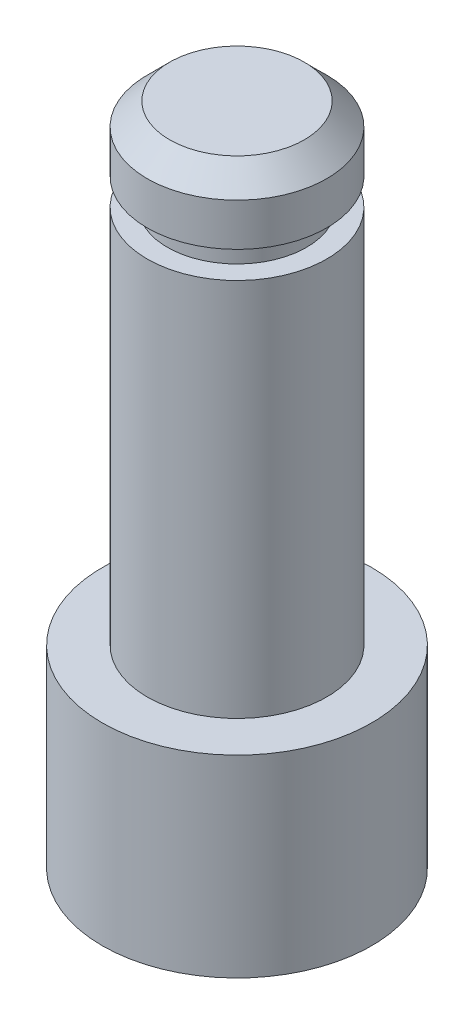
ISO-10303-21;
HEADER;
FILE_DESCRIPTION(('STEP AP214'),'2;1');
FILE_NAME('part.step','',(''),(''),'','','');
FILE_SCHEMA(('AUTOMOTIVE_DESIGN { 1 0 10303 214 1 1 1 1 }'));
ENDSEC;
DATA;
#1=APPLICATION_CONTEXT('core data for automotive mechanical design processes');
#2=APPLICATION_PROTOCOL_DEFINITION('international standard','automotive_design',2000,#1);
#3=PRODUCT_CONTEXT('',#1,'mechanical');
#4=PRODUCT('Part','Part','',(#3));
#5=PRODUCT_RELATED_PRODUCT_CATEGORY('part','',(#4));
#6=PRODUCT_DEFINITION_FORMATION('','',#4);
#7=PRODUCT_DEFINITION_CONTEXT('part definition',#1,'design');
#8=PRODUCT_DEFINITION('design','',#6,#7);
#9=PRODUCT_DEFINITION_SHAPE('','',#8);
#10=(LENGTH_UNIT() NAMED_UNIT(*) SI_UNIT(.MILLI.,.METRE.));
#11=(NAMED_UNIT(*) PLANE_ANGLE_UNIT() SI_UNIT($,.RADIAN.));
#12=(NAMED_UNIT(*) SI_UNIT($,.STERADIAN.) SOLID_ANGLE_UNIT());
#13=UNCERTAINTY_MEASURE_WITH_UNIT(LENGTH_MEASURE(1.E-05),#10,'distance_accuracy_value','');
#14=(GEOMETRIC_REPRESENTATION_CONTEXT(3) GLOBAL_UNCERTAINTY_ASSIGNED_CONTEXT((#13)) GLOBAL_UNIT_ASSIGNED_CONTEXT((#10,
#11,#12)) REPRESENTATION_CONTEXT('',''));
#15=CARTESIAN_POINT('',(0.,0.,0.));
#16=DIRECTION('',(0.,0.,1.));
#17=DIRECTION('',(1.,0.,0.));
#18=AXIS2_PLACEMENT_3D('',#15,#16,#17);
#19=CARTESIAN_POINT('',(0.,0.,0.));
#20=DIRECTION('',(0.,1.,0.));
#21=DIRECTION('',(0.,0.,1.));
#22=AXIS2_PLACEMENT_3D('',#19,#20,#21);
#23=CYLINDRICAL_SURFACE('',#22,3.);
#24=CARTESIAN_POINT('',(0.,20.,0.));
#25=DIRECTION('',(0.,1.,0.));
#26=DIRECTION('',(0.,0.,1.));
#27=AXIS2_PLACEMENT_3D('',#24,#25,#26);
#28=CIRCLE('',#27,3.);
#29=CARTESIAN_POINT('',(0.,20.,3.));
#30=VERTEX_POINT('',#29);
#31=EDGE_CURVE('E55',#30,#30,#28,.T.);
#32=ORIENTED_EDGE('',*,*,#31,.F.);
#33=EDGE_LOOP('',(#32));
#34=FACE_BOUND('',#33,.T.);
#35=CARTESIAN_POINT('',(0.,15.7,0.));
#36=DIRECTION('',(0.,-1.,0.));
#37=DIRECTION('',(0.,0.,-1.));
#38=AXIS2_PLACEMENT_3D('',#35,#36,#37);
#39=CIRCLE('',#38,3.);
#40=CARTESIAN_POINT('',(0.,15.7,-3.));
#41=VERTEX_POINT('',#40);
#42=EDGE_CURVE('E37',#41,#41,#39,.F.);
#43=ORIENTED_EDGE('',*,*,#42,.T.);
#44=EDGE_LOOP('',(#43));
#45=FACE_BOUND('',#44,.T.);
#46=ADVANCED_FACE('F33',(#34,#45),#23,.T.);
#47=CARTESIAN_POINT('',(0.,0.,0.));
#48=DIRECTION('',(0.,1.,0.));
#49=DIRECTION('',(0.,0.,1.));
#50=AXIS2_PLACEMENT_3D('',#47,#48,#49);
#51=CYLINDRICAL_SURFACE('',#50,2.);
#52=CARTESIAN_POINT('',(0.,20.,0.));
#53=DIRECTION('',(0.,1.,0.));
#54=DIRECTION('',(0.,0.,1.));
#55=AXIS2_PLACEMENT_3D('',#52,#53,#54);
#56=CIRCLE('',#55,2.);
#57=CARTESIAN_POINT('',(0.,20.,2.));
#58=VERTEX_POINT('',#57);
#59=EDGE_CURVE('E46',#58,#58,#56,.T.);
#60=ORIENTED_EDGE('',*,*,#59,.T.);
#61=EDGE_LOOP('',(#60));
#62=FACE_BOUND('',#61,.T.);
#63=CARTESIAN_POINT('',(0.,28.45,0.));
#64=DIRECTION('',(0.,1.,0.));
#65=DIRECTION('',(0.,0.,1.));
#66=AXIS2_PLACEMENT_3D('',#63,#64,#65);
#67=CIRCLE('',#66,2.);
#68=CARTESIAN_POINT('',(0.,28.45,2.));
#69=VERTEX_POINT('',#68);
#70=EDGE_CURVE('E52',#69,#69,#67,.F.);
#71=ORIENTED_EDGE('',*,*,#70,.T.);
#72=EDGE_LOOP('',(#71));
#73=FACE_BOUND('',#72,.T.);
#74=ADVANCED_FACE('F82',(#62,#73),#51,.T.);
#75=CARTESIAN_POINT('',(-3.,20.,0.));
#76=DIRECTION('',(0.,1.,0.));
#77=DIRECTION('',(0.,0.,1.));
#78=AXIS2_PLACEMENT_3D('',#75,#76,#77);
#79=PLANE('',#78);
#80=ORIENTED_EDGE('',*,*,#31,.T.);
#81=EDGE_LOOP('',(#80));
#82=FACE_BOUND('',#81,.T.);
#83=ORIENTED_EDGE('',*,*,#59,.F.);
#84=EDGE_LOOP('',(#83));
#85=FACE_BOUND('',#84,.T.);
#86=ADVANCED_FACE('F90',(#82,#85),#79,.T.);
#87=CARTESIAN_POINT('',(-3.,28.45,0.));
#88=DIRECTION('',(0.,1.,0.));
#89=DIRECTION('',(0.,0.,1.));
#90=AXIS2_PLACEMENT_3D('',#87,#88,#89);
#91=PLANE('',#90);
#92=ORIENTED_EDGE('',*,*,#70,.F.);
#93=EDGE_LOOP('',(#92));
#94=FACE_BOUND('',#93,.T.);
#95=CARTESIAN_POINT('',(0.,28.45,0.));
#96=DIRECTION('',(0.,-1.,0.));
#97=DIRECTION('',(0.,0.,-1.));
#98=AXIS2_PLACEMENT_3D('',#95,#96,#97);
#99=CIRCLE('',#98,1.55);
#100=CARTESIAN_POINT('',(0.,28.45,-1.55));
#101=VERTEX_POINT('',#100);
#102=EDGE_CURVE('E53',#101,#101,#99,.T.);
#103=ORIENTED_EDGE('',*,*,#102,.T.);
#104=EDGE_LOOP('',(#103));
#105=FACE_BOUND('',#104,.T.);
#106=ADVANCED_FACE('F96',(#94,#105),#91,.T.);
#107=CARTESIAN_POINT('',(0.,0.,0.));
#108=DIRECTION('',(0.,-1.,0.));
#109=DIRECTION('',(0.,0.,-1.));
#110=AXIS2_PLACEMENT_3D('',#107,#108,#109);
#111=CYLINDRICAL_SURFACE('',#110,1.55);
#112=CARTESIAN_POINT('',(0.,29.05,0.));
#113=DIRECTION('',(0.,-1.,0.));
#114=DIRECTION('',(0.,0.,-1.));
#115=AXIS2_PLACEMENT_3D('',#112,#113,#114);
#116=CIRCLE('',#115,1.55);
#117=CARTESIAN_POINT('',(0.,29.05,-1.55));
#118=VERTEX_POINT('',#117);
#119=EDGE_CURVE('E66',#118,#118,#116,.T.);
#120=ORIENTED_EDGE('',*,*,#119,.T.);
#121=EDGE_LOOP('',(#120));
#122=FACE_BOUND('',#121,.T.);
#123=ORIENTED_EDGE('',*,*,#102,.F.);
#124=EDGE_LOOP('',(#123));
#125=FACE_BOUND('',#124,.T.);
#126=ADVANCED_FACE('F100',(#122,#125),#111,.T.);
#127=CARTESIAN_POINT('',(-3.,29.05,0.));
#128=DIRECTION('',(0.,-1.,0.));
#129=DIRECTION('',(0.,0.,-1.));
#130=AXIS2_PLACEMENT_3D('',#127,#128,#129);
#131=PLANE('',#130);
#132=CARTESIAN_POINT('',(0.,29.05,0.));
#133=DIRECTION('',(0.,-1.,0.));
#134=DIRECTION('',(0.,0.,-1.));
#135=AXIS2_PLACEMENT_3D('',#132,#133,#134);
#136=CIRCLE('',#135,2.);
#137=CARTESIAN_POINT('',(0.,29.05,-2.));
#138=VERTEX_POINT('',#137);
#139=EDGE_CURVE('E50',#138,#138,#136,.F.);
#140=ORIENTED_EDGE('',*,*,#139,.F.);
#141=EDGE_LOOP('',(#140));
#142=FACE_BOUND('',#141,.T.);
#143=ORIENTED_EDGE('',*,*,#119,.F.);
#144=EDGE_LOOP('',(#143));
#145=FACE_BOUND('',#144,.T.);
#146=ADVANCED_FACE('F107',(#142,#145),#131,.T.);
#147=CARTESIAN_POINT('',(-2.,30.5,0.));
#148=DIRECTION('',(0.,1.,0.));
#149=DIRECTION('',(0.,0.,1.));
#150=AXIS2_PLACEMENT_3D('',#147,#148,#149);
#151=PLANE('',#150);
#152=CARTESIAN_POINT('',(0.,30.5,0.));
#153=DIRECTION('',(0.,1.,0.));
#154=DIRECTION('',(0.,0.,1.));
#155=AXIS2_PLACEMENT_3D('',#152,#153,#154);
#156=CIRCLE('',#155,1.5);
#157=CARTESIAN_POINT('',(0.,30.5,1.5));
#158=VERTEX_POINT('',#157);
#159=EDGE_CURVE('E41',#158,#158,#156,.T.);
#160=ORIENTED_EDGE('',*,*,#159,.T.);
#161=EDGE_LOOP('',(#160));
#162=FACE_BOUND('',#161,.T.);
#163=ADVANCED_FACE('F35',(#162),#151,.T.);
#164=CARTESIAN_POINT('',(0.,30.5,0.));
#165=DIRECTION('',(0.,-1.,0.));
#166=DIRECTION('',(0.,0.,-1.));
#167=AXIS2_PLACEMENT_3D('',#164,#165,#166);
#168=CONICAL_SURFACE('',#167,1.5,0.785398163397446);
#169=CARTESIAN_POINT('',(0.,30.,0.));
#170=DIRECTION('',(0.,1.,0.));
#171=DIRECTION('',(0.,0.,1.));
#172=AXIS2_PLACEMENT_3D('',#169,#170,#171);
#173=CIRCLE('',#172,2.);
#174=CARTESIAN_POINT('',(0.,30.,2.));
#175=VERTEX_POINT('',#174);
#176=EDGE_CURVE('E10',#175,#175,#173,.F.);
#177=ORIENTED_EDGE('',*,*,#176,.F.);
#178=EDGE_LOOP('',(#177));
#179=FACE_BOUND('',#178,.T.);
#180=ORIENTED_EDGE('',*,*,#159,.F.);
#181=EDGE_LOOP('',(#180));
#182=FACE_BOUND('',#181,.T.);
#183=ADVANCED_FACE('F81',(#179,#182),#168,.T.);
#184=ORIENTED_EDGE('',*,*,#176,.T.);
#185=EDGE_LOOP('',(#184));
#186=FACE_BOUND('',#185,.T.);
#187=ORIENTED_EDGE('',*,*,#139,.T.);
#188=EDGE_LOOP('',(#187));
#189=FACE_BOUND('',#188,.T.);
#190=ADVANCED_FACE('F76',(#186,#189),#51,.T.);
#191=CARTESIAN_POINT('',(0.,15.7,0.));
#192=DIRECTION('',(0.,-1.,0.));
#193=DIRECTION('',(0.,0.,-1.));
#194=AXIS2_PLACEMENT_3D('',#191,#192,#193);
#195=PLANE('',#194);
#196=ORIENTED_EDGE('',*,*,#42,.F.);
#197=EDGE_LOOP('',(#196));
#198=FACE_BOUND('',#197,.T.);
#199=ADVANCED_FACE('F74',(#198),#195,.T.);
#200=CLOSED_SHELL('',(#46,#74,#86,#106,#126,#146,#163,#183,#190,#199));
#201=MANIFOLD_SOLID_BREP('B2',#200);
#202=ADVANCED_BREP_SHAPE_REPRESENTATION('',(#18,#201),#14);
#203=SHAPE_DEFINITION_REPRESENTATION(#9,#202);
ENDSEC;
END-ISO-10303-21;
